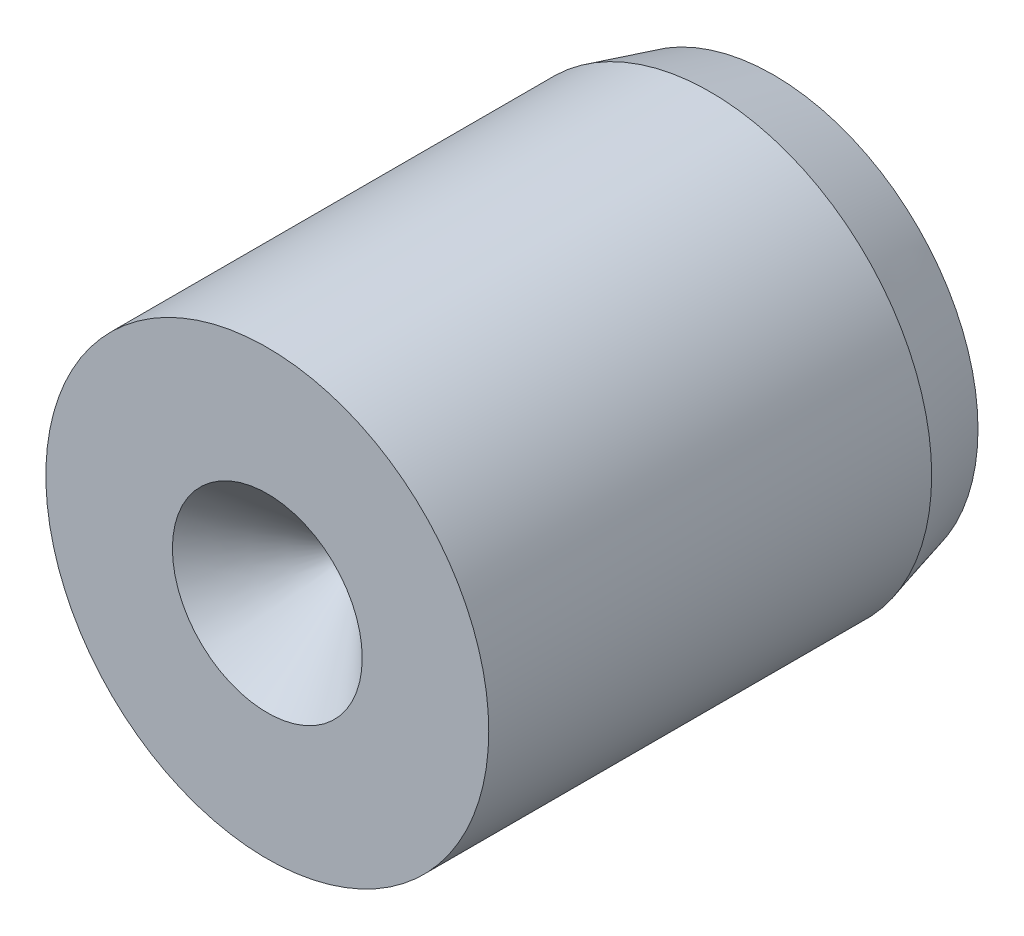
ISO-10303-21;
HEADER;
FILE_DESCRIPTION(('STEP AP214'),'2;1');
FILE_NAME('part.step','',(''),(''),'','','');
FILE_SCHEMA(('AUTOMOTIVE_DESIGN { 1 0 10303 214 1 1 1 1 }'));
ENDSEC;
DATA;
#1=APPLICATION_CONTEXT('core data for automotive mechanical design processes');
#2=APPLICATION_PROTOCOL_DEFINITION('international standard','automotive_design',2000,#1);
#3=PRODUCT_CONTEXT('',#1,'mechanical');
#4=PRODUCT('Part','Part','',(#3));
#5=PRODUCT_RELATED_PRODUCT_CATEGORY('part','',(#4));
#6=PRODUCT_DEFINITION_FORMATION('','',#4);
#7=PRODUCT_DEFINITION_CONTEXT('part definition',#1,'design');
#8=PRODUCT_DEFINITION('design','',#6,#7);
#9=PRODUCT_DEFINITION_SHAPE('','',#8);
#10=(LENGTH_UNIT() NAMED_UNIT(*) SI_UNIT(.MILLI.,.METRE.));
#11=(NAMED_UNIT(*) PLANE_ANGLE_UNIT() SI_UNIT($,.RADIAN.));
#12=(NAMED_UNIT(*) SI_UNIT($,.STERADIAN.) SOLID_ANGLE_UNIT());
#13=UNCERTAINTY_MEASURE_WITH_UNIT(LENGTH_MEASURE(1.E-05),#10,'distance_accuracy_value','');
#14=(GEOMETRIC_REPRESENTATION_CONTEXT(3) GLOBAL_UNCERTAINTY_ASSIGNED_CONTEXT((#13)) GLOBAL_UNIT_ASSIGNED_CONTEXT((#10,
#11,#12)) REPRESENTATION_CONTEXT('',''));
#15=CARTESIAN_POINT('',(0.,0.,0.));
#16=DIRECTION('',(0.,0.,1.));
#17=DIRECTION('',(1.,0.,0.));
#18=AXIS2_PLACEMENT_3D('',#15,#16,#17);
#19=CARTESIAN_POINT('',(0.,3.5,8.));
#20=DIRECTION('',(0.,0.,-1.));
#21=DIRECTION('',(-1.,0.,0.));
#22=AXIS2_PLACEMENT_3D('',#19,#20,#21);
#23=PLANE('',#22);
#24=CARTESIAN_POINT('',(0.,0.,8.));
#25=DIRECTION('',(0.,0.,1.));
#26=DIRECTION('',(1.,0.,0.));
#27=AXIS2_PLACEMENT_3D('',#24,#25,#26);
#28=CIRCLE('',#27,1.5);
#29=CARTESIAN_POINT('',(1.5,0.,8.));
#30=VERTEX_POINT('',#29);
#31=EDGE_CURVE('E9',#30,#30,#28,.T.);
#32=ORIENTED_EDGE('',*,*,#31,.F.);
#33=EDGE_LOOP('',(#32));
#34=FACE_BOUND('',#33,.T.);
#35=CARTESIAN_POINT('',(0.,0.,8.));
#36=DIRECTION('',(0.,0.,1.));
#37=DIRECTION('',(1.,0.,0.));
#38=AXIS2_PLACEMENT_3D('',#35,#36,#37);
#39=CIRCLE('',#38,3.5);
#40=CARTESIAN_POINT('',(3.5,0.,8.));
#41=VERTEX_POINT('',#40);
#42=EDGE_CURVE('E33',#41,#41,#39,.T.);
#43=ORIENTED_EDGE('',*,*,#42,.T.);
#44=EDGE_LOOP('',(#43));
#45=FACE_BOUND('',#44,.T.);
#46=ADVANCED_FACE('F14',(#34,#45),#23,.F.);
#47=CARTESIAN_POINT('',(0.,0.,8.));
#48=DIRECTION('',(0.,0.,1.));
#49=DIRECTION('',(1.,0.,0.));
#50=AXIS2_PLACEMENT_3D('',#47,#48,#49);
#51=CONICAL_SURFACE('',#50,1.5,0.78539816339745);
#52=CARTESIAN_POINT('',(0.,0.,6.5));
#53=VERTEX_POINT('',#52);
#54=VERTEX_LOOP('',#53);
#55=FACE_BOUND('',#54,.T.);
#56=ORIENTED_EDGE('',*,*,#31,.T.);
#57=EDGE_LOOP('',(#56));
#58=FACE_BOUND('',#57,.T.);
#59=ADVANCED_FACE('F23',(#55,#58),#51,.F.);
#60=CARTESIAN_POINT('',(0.,3.23205080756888,0.));
#61=DIRECTION('',(0.,0.,-1.));
#62=DIRECTION('',(-1.,0.,0.));
#63=AXIS2_PLACEMENT_3D('',#60,#61,#62);
#64=PLANE('',#63);
#65=CARTESIAN_POINT('',(0.,0.,0.));
#66=DIRECTION('',(0.,0.,1.));
#67=DIRECTION('',(1.,0.,0.));
#68=AXIS2_PLACEMENT_3D('',#65,#66,#67);
#69=CIRCLE('',#68,3.23205080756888);
#70=CARTESIAN_POINT('',(3.23205080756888,0.,0.));
#71=VERTEX_POINT('',#70);
#72=EDGE_CURVE('E20',#71,#71,#69,.T.);
#73=ORIENTED_EDGE('',*,*,#72,.F.);
#74=EDGE_LOOP('',(#73));
#75=FACE_BOUND('',#74,.T.);
#76=ADVANCED_FACE('F26',(#75),#64,.T.);
#77=CARTESIAN_POINT('',(0.,0.,1.));
#78=DIRECTION('',(0.,0.,1.));
#79=DIRECTION('',(1.,0.,0.));
#80=AXIS2_PLACEMENT_3D('',#77,#78,#79);
#81=CONICAL_SURFACE('',#80,3.5,0.26179938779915);
#82=ORIENTED_EDGE('',*,*,#72,.T.);
#83=EDGE_LOOP('',(#82));
#84=FACE_BOUND('',#83,.T.);
#85=CARTESIAN_POINT('',(0.,0.,1.));
#86=DIRECTION('',(0.,0.,1.));
#87=DIRECTION('',(1.,0.,0.));
#88=AXIS2_PLACEMENT_3D('',#85,#86,#87);
#89=CIRCLE('',#88,3.5);
#90=CARTESIAN_POINT('',(3.5,0.,1.));
#91=VERTEX_POINT('',#90);
#92=EDGE_CURVE('E35',#91,#91,#89,.T.);
#93=ORIENTED_EDGE('',*,*,#92,.F.);
#94=EDGE_LOOP('',(#93));
#95=FACE_BOUND('',#94,.T.);
#96=ADVANCED_FACE('F42',(#84,#95),#81,.T.);
#97=CARTESIAN_POINT('',(0.,0.,7.));
#98=DIRECTION('',(0.,0.,1.));
#99=DIRECTION('',(1.,0.,0.));
#100=AXIS2_PLACEMENT_3D('',#97,#98,#99);
#101=CYLINDRICAL_SURFACE('',#100,3.5);
#102=ORIENTED_EDGE('',*,*,#92,.T.);
#103=EDGE_LOOP('',(#102));
#104=FACE_BOUND('',#103,.T.);
#105=ORIENTED_EDGE('',*,*,#42,.F.);
#106=EDGE_LOOP('',(#105));
#107=FACE_BOUND('',#106,.T.);
#108=ADVANCED_FACE('F51',(#104,#107),#101,.T.);
#109=CLOSED_SHELL('',(#46,#59,#76,#96,#108));
#110=MANIFOLD_SOLID_BREP('B1',#109);
#111=ADVANCED_BREP_SHAPE_REPRESENTATION('',(#18,#110),#14);
#112=SHAPE_DEFINITION_REPRESENTATION(#9,#111);
ENDSEC;
END-ISO-10303-21;
